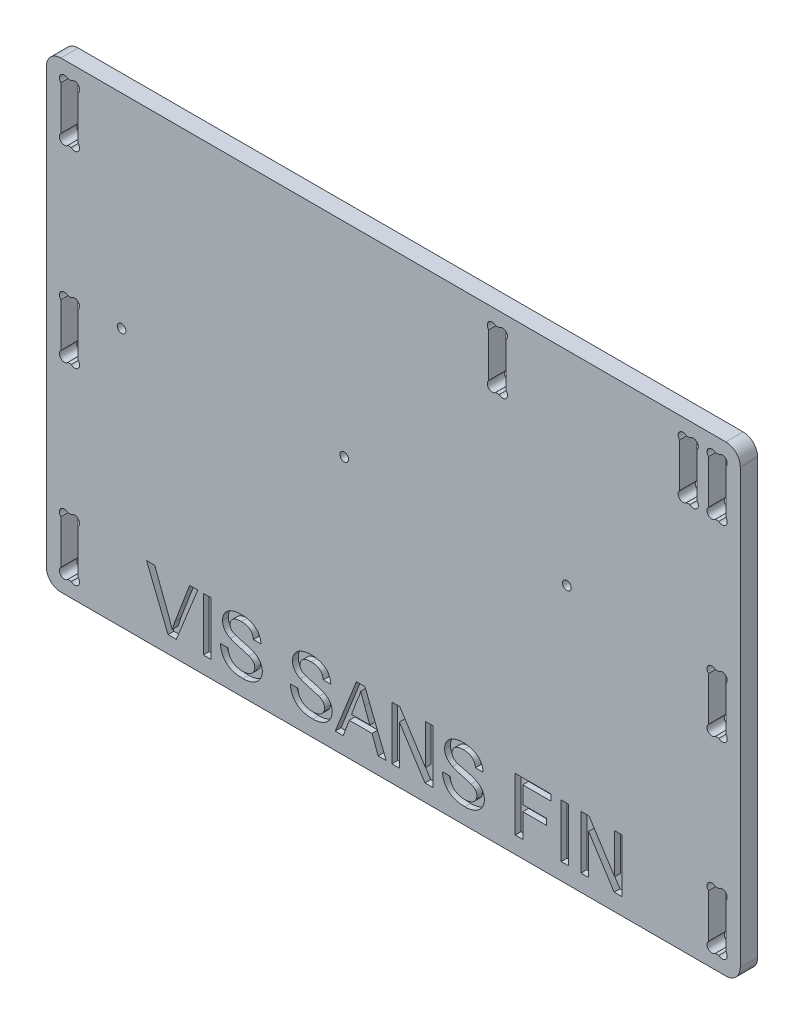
from build123d import *

# Parameters (mm, degrees)
ESQUISSE1_R             = 1.5
EXTRUSION1_DEPTH        = 6
ESQUISSE3_W             = 2.60783128
ESQUISSE3_H             = 18.491894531
ENL_V_MAT_EXTRU_1_DEPTH = 2


with BuildPart() as part:
    # Esquisse1 → Extrusion1 (new body)
    with BuildSketch(Plane.XY):
        with BuildLine():
            Line((5, 160), (235, 160))
            ThreePointArc((235, 160), (238.535533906, 158.535533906), (240, 155))
            Line((240, 155), (240, 5))
            ThreePointArc((240, 5), (238.535533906, 1.464466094), (235, 0))
            Line((235, 0), (5, 0))
            ThreePointArc((5, 0), (1.464466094, 1.464466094), (0, 5))
            Line((0, 5), (0, 155))
            ThreePointArc((0, 155), (1.464466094, 158.535533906), (5, 160))
        make_face()
        with Locations((26, 89.5)):
            Circle(ESQUISSE1_R, mode=Mode.SUBTRACT)
        with Locations(Location((103, 89.5, 0), (0, 0, 180))):
            Circle(ESQUISSE1_R, mode=Mode.SUBTRACT)
        with Locations(Location((180, 89.5, 0), (0, 0, 180))):
            Circle(ESQUISSE1_R, mode=Mode.SUBTRACT)
        with BuildLine():
            Line((7.404163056, 25), (8.595836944, 25))
            ThreePointArc((8.595836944, 25), (11, 25), (11, 22.595836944))
            Line((11, 22.595836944), (11, 7.404163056))
            ThreePointArc((11, 7.404163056), (11, 5), (8.595836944, 5))
            Line((8.595836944, 5), (7.404163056, 5))
            ThreePointArc((7.404163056, 5), (5, 5), (5, 7.404163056))
            Line((5, 7.404163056), (5, 22.595836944))
            ThreePointArc((5, 22.595836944), (5, 25), (7.404163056, 25))
        make_face(mode=Mode.SUBTRACT)
        with BuildLine():
            Line((156.595836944, 135), (155.404163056, 135))
            ThreePointArc((155.404163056, 135), (153, 135), (153, 137.404163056))
            Line((153, 137.404163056), (153, 152.595836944))
            ThreePointArc((153, 152.595836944), (153, 155), (155.404163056, 155))
            Line((155.404163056, 155), (156.595836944, 155))
            ThreePointArc((156.595836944, 155), (159, 155), (159, 152.595836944))
            Line((159, 152.595836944), (159, 137.404163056))
            ThreePointArc((159, 137.404163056), (159, 135), (156.595836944, 135))
        make_face(mode=Mode.SUBTRACT)
        with BuildLine():
            Line((5, 137.404163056), (5, 152.595836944))
            ThreePointArc((5, 152.595836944), (5, 155), (7.404163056, 155))
            Line((7.404163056, 155), (8.595836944, 155))
            ThreePointArc((8.595836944, 155), (11, 155), (11, 152.595836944))
            Line((11, 152.595836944), (11, 137.404163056))
            ThreePointArc((11, 137.404163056), (11, 135), (8.595836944, 135))
            Line((8.595836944, 135), (7.404163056, 135))
            ThreePointArc((7.404163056, 135), (5, 135), (5, 137.404163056))
        make_face(mode=Mode.SUBTRACT)
        with BuildLine():
            Line((7.404163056, 90), (8.595836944, 90))
            ThreePointArc((8.595836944, 90), (11, 90), (11, 87.595836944))
            Line((11, 87.595836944), (11, 72.404163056))
            ThreePointArc((11, 72.404163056), (11, 70), (8.595836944, 70))
            Line((8.595836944, 70), (7.404163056, 70))
            ThreePointArc((7.404163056, 70), (5, 70), (5, 72.404163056))
            Line((5, 72.404163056), (5, 87.595836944))
            ThreePointArc((5, 87.595836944), (5, 90), (7.404163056, 90))
        make_face(mode=Mode.SUBTRACT)
        with BuildLine():
            Line((235, 22.595836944), (235, 7.404163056))
            ThreePointArc((235, 7.404163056), (235, 5), (232.595836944, 5))
            Line((232.595836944, 5), (231.404163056, 5))
            ThreePointArc((231.404163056, 5), (229, 5), (229, 7.404163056))
            Line((229, 7.404163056), (229, 22.595836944))
            ThreePointArc((229, 22.595836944), (229, 25), (231.404163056, 25))
            Line((231.404163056, 25), (232.595836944, 25))
            ThreePointArc((232.595836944, 25), (235, 25), (235, 22.595836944))
        make_face(mode=Mode.SUBTRACT)
        with BuildLine():
            Line((232.595836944, 70), (231.404163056, 70))
            ThreePointArc((231.404163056, 70), (229, 70), (229, 72.404163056))
            Line((229, 72.404163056), (229, 87.595836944))
            ThreePointArc((229, 87.595836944), (229, 90), (231.404163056, 90))
            Line((231.404163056, 90), (232.595836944, 90))
            ThreePointArc((232.595836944, 90), (235, 90), (235, 87.595836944))
            Line((235, 87.595836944), (235, 72.404163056))
            ThreePointArc((235, 72.404163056), (235, 70), (232.595836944, 70))
        make_face(mode=Mode.SUBTRACT)
        with BuildLine():
            Line((232.595836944, 135), (231.404163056, 135))
            ThreePointArc((231.404163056, 135), (229, 135), (229, 137.404163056))
            Line((229, 137.404163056), (229, 152.595836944))
            ThreePointArc((229, 152.595836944), (229, 155), (231.404163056, 155))
            Line((231.404163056, 155), (232.595836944, 155))
            ThreePointArc((232.595836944, 155), (235, 155), (235, 152.595836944))
            Line((235, 152.595836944), (235, 137.404163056))
            ThreePointArc((235, 137.404163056), (235, 135), (232.595836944, 135))
        make_face(mode=Mode.SUBTRACT)
        with BuildLine():
            Line((221.404163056, 135), (222.595836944, 135))
            ThreePointArc((222.595836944, 135), (225, 135), (225, 137.404163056))
            Line((225, 137.404163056), (225, 152.595836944))
            ThreePointArc((225, 152.595836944), (225, 155), (222.595836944, 155))
            Line((222.595836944, 155), (221.404163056, 155))
            ThreePointArc((221.404163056, 155), (219, 155), (219, 152.595836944))
            Line((219, 152.595836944), (219, 137.404163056))
            ThreePointArc((219, 137.404163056), (219, 135), (221.404163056, 135))
        make_face(mode=Mode.SUBTRACT)
    extrude(amount=EXTRUSION1_DEPTH)

    # Esquisse3 → Enl_v. mat.-Extru.1 (cut)
    # profile 1 of 10: a face of its own
    with BuildSketch(Plane.XY.offset(6)):
        with BuildLine():
            Line((42.089619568, 5.811423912), (34.632852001, 24.303318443))
            Line((34.632852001, 24.303318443), (37.459237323, 24.303318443))
            Line((37.459237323, 24.303318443), (42.489684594, 11.049312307))
            add(Edge.make_bspline(
                [(42.489684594, 11.049312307), (42.58812546, 10.787871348), (42.780696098, 10.276438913), (43.049236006, 9.517508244), (43.289294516, 8.783583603), (43.434022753, 8.299783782), (43.504664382, 8.063641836)],
                knots=[0, 0, 0, 0, 1.062747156, 2.078952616, 3.062339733, 4, 4, 4, 4], degree=3))
            add(Edge.make_bspline(
                [(43.504664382, 8.063641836), (43.655050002, 8.56299949), (43.957977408, 9.568874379), (44.32414454, 10.553496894), (44.508531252, 11.049312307)],
                knots=[0, 0, 0, 0, 0.992882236, 2, 2, 2, 2], degree=3))
            Line((44.508531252, 11.049312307), (49.55009144, 24.303318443))
            Line((49.55009144, 24.303318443), (52.376476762, 24.303318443))
            Line((52.376476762, 24.303318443), (44.91600489, 5.811423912))
            Line((44.91600489, 5.811423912), (42.089619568, 5.811423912))
        make_face()
    # profile 2 of 10: a face of its own
    with BuildSketch(Plane.XY.offset(6)):
        with Locations((55.595518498, 15.057371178)):
            Rectangle(ESQUISSE3_W, ESQUISSE3_H)
    # profile 3 of 10: a face of its own
    with BuildSketch(Plane.XY.offset(6)):
        with BuildLine():
            Line((60.218492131, 12.212464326), (62.826323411, 12.212464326))
            add(Edge.make_bspline(
                [(62.826323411, 12.212464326), (62.855008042, 11.978316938), (62.910112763, 11.528507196), (63.064191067, 10.8909696), (63.262499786, 10.317757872), (63.509586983, 9.80126448), (63.834620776, 9.34768215), (64.226230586, 8.938557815), (64.701819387, 8.584280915), (65.238650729, 8.268997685), (65.836531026, 8.021450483), (66.474821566, 7.837939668), (67.15047826, 7.729208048), (67.613126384, 7.715187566), (67.84936207, 7.708028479)],
                knots=[0, 0, 0, 0, 1.125557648, 2.162256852, 3.1243583, 4.018160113, 4.88511607, 5.777380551, 6.711250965, 7.707237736, 8.743031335, 9.791730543, 10.872421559, 12, 12, 12, 12], degree=3))
            add(Edge.make_bspline(
                [(67.84936207, 7.708028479), (68.058410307, 7.711897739), (68.466013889, 7.719442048), (69.055658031, 7.81006788), (69.610514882, 7.938618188), (70.120257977, 8.133070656), (70.583006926, 8.369196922), (70.984852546, 8.654797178), (71.32792696, 8.976875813), (71.596579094, 9.343916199), (71.807626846, 9.728513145), (71.96245219, 10.12383914), (72.054678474, 10.527699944), (72.066430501, 10.799438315), (72.072270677, 10.934478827)],
                knots=[0, 0, 0, 0, 1.267006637, 2.470417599, 3.611360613, 4.716023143, 5.771382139, 6.754486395, 7.697536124, 8.612899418, 9.501261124, 10.352596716, 11.181322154, 12, 12, 12, 12], degree=3))
            add(Edge.make_bspline(
                [(72.072270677, 10.934478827), (72.066027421, 11.068151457), (72.053824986, 11.329414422), (71.974305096, 11.709780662), (71.823166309, 12.057926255), (71.627046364, 12.38806088), (71.354210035, 12.689897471), (71.009512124, 12.968012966), (70.58535807, 13.220155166), (70.26879088, 13.358242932), (70.101579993, 13.431180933)],
                knots=[0, 0, 0, 0, 0.942140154, 1.841411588, 2.718743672, 3.605002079, 4.535543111, 5.568170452, 6.715506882, 8, 8, 8, 8], degree=3))
            add(Edge.make_bspline(
                [(70.101579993, 13.431180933), (70.036432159, 13.457915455), (69.889251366, 13.518313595), (69.636990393, 13.598270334), (69.337650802, 13.701662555), (68.9840412, 13.808139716), (68.578054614, 13.920777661), (68.120366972, 14.048266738), (67.611234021, 14.183844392), (67.065095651, 14.328152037), (66.513662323, 14.474890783), (65.986832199, 14.621766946), (65.50212344, 14.770865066), (65.055565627, 14.914425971), (64.649460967, 15.058579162), (64.282656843, 15.199378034), (63.954695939, 15.333965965), (63.754389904, 15.432926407), (63.659792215, 15.479662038)],
                knots=[0, 0, 0, 0, 0.499201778, 1.127787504, 1.87543728, 2.745208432, 3.745951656, 4.863402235, 6.114490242, 7.482339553, 8.869366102, 10.161191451, 11.360587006, 12.46547846, 13.487450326, 14.41601931, 15.251940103, 16, 16, 16, 16], degree=3))
            add(Edge.make_bspline(
                [(63.659792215, 15.479662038), (63.442149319, 15.597239), (63.022041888, 15.824193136), (62.456623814, 16.229987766), (61.980201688, 16.680292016), (61.594785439, 17.174452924), (61.292749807, 17.704113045), (61.088967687, 18.270172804), (60.949393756, 18.862357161), (60.936350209, 19.269576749), (60.929718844, 19.476607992)],
                knots=[0, 0, 0, 0, 1.158441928, 2.236094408, 3.251151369, 4.220012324, 5.163146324, 6.095083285, 7.031536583, 8, 8, 8, 8], degree=3))
            add(Edge.make_bspline(
                [(60.929718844, 19.476607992), (60.938519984, 19.705860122), (60.95602539, 20.161840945), (61.111307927, 20.830964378), (61.358986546, 21.474839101), (61.640920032, 21.986020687), (61.915867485, 22.372573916), (62.143801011, 22.650962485), (62.399473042, 22.90829529), (62.675009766, 23.148164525), (62.975336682, 23.366986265), (63.29300265, 23.573753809), (63.639505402, 23.751475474), (64.1263933, 23.977675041), (64.77773199, 24.203556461), (65.597685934, 24.400383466), (66.460660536, 24.516290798), (67.048884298, 24.532245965), (67.349280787, 24.540394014)],
                knots=[0, 0, 0, 0, 1.199927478, 2.386647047, 3.578628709, 4.806592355, 5.433127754, 6.062729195, 6.689531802, 7.331674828, 7.974827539, 8.635320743, 9.315455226, 10.01318112, 11.447700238, 12.918145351, 14.426146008, 16, 16, 16, 16], degree=3))
            add(Edge.make_bspline(
                [(67.349280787, 24.540394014), (67.678084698, 24.532859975), (68.318329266, 24.518189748), (69.24862272, 24.396136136), (70.116331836, 24.186537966), (70.796819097, 23.951913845), (71.299895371, 23.714388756), (71.657294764, 23.52905034), (71.989032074, 23.31476537), (72.298093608, 23.082875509), (72.587350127, 22.83348666), (72.84936709, 22.560666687), (73.095522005, 22.273723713), (73.384788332, 21.861763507), (73.696678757, 21.316536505), (73.966350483, 20.610173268), (74.151618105, 19.864664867), (74.18765692, 19.349275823), (74.205950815, 19.087655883)],
                knots=[0, 0, 0, 0, 1.607600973, 3.130308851, 4.577334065, 5.967726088, 6.640410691, 7.296826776, 7.935019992, 8.569057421, 9.185393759, 9.8003086, 10.417295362, 11.032210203, 12.259799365, 13.477607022, 14.719591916, 16, 16, 16, 16], degree=3))
            Line((74.205950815, 19.087655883), (71.598119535, 19.087655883))
            add(Edge.make_bspline(
                [(71.598119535, 19.087655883), (71.581549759, 19.220069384), (71.549127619, 19.479163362), (71.468692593, 19.854240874), (71.355938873, 20.202595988), (71.223869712, 20.527477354), (71.063774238, 20.825505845), (70.877149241, 21.09954319), (70.661722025, 21.346360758), (70.423035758, 21.572480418), (70.153827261, 21.769367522), (69.855479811, 21.940271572), (69.527489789, 22.08464636), (69.170146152, 22.20289402), (68.783378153, 22.294578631), (68.366306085, 22.362023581), (67.919091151, 22.396565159), (67.611101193, 22.403271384), (67.45300135, 22.406713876)],
                knots=[0, 0, 0, 0, 1.074487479, 2.102453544, 3.083708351, 4.020042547, 4.923259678, 5.803182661, 6.684453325, 7.556870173, 8.445961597, 9.363679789, 10.320905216, 11.327237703, 12.390948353, 13.519046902, 14.726457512, 16, 16, 16, 16], degree=3))
            add(Edge.make_bspline(
                [(67.45300135, 22.406713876), (67.288663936, 22.405475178), (66.970547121, 22.403077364), (66.510673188, 22.359368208), (66.084429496, 22.299397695), (65.692548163, 22.210936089), (65.336312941, 22.09513955), (65.01043679, 21.961421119), (64.724039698, 21.791964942), (64.470445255, 21.603212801), (64.251687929, 21.394368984), (64.063151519, 21.174298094), (63.896405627, 20.949465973), (63.766840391, 20.707583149), (63.661354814, 20.457810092), (63.593305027, 20.195451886), (63.545124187, 19.925361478), (63.5401097, 19.741073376), (63.537550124, 19.647006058)],
                knots=[0, 0, 0, 0, 1.464176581, 2.834285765, 4.113735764, 5.29917439, 6.409476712, 7.449999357, 8.431575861, 9.367089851, 10.262376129, 11.120706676, 11.948504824, 12.751342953, 13.560717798, 14.359016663, 15.162382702, 16, 16, 16, 16], degree=3))
            add(Edge.make_bspline(
                [(63.537550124, 19.647006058), (63.544289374, 19.487909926), (63.557369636, 19.179119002), (63.690938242, 18.740420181), (63.896367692, 18.340517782), (64.098748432, 18.122932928), (64.200620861, 18.013407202)],
                knots=[0, 0, 0, 0, 1.050964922, 2.039826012, 3.013306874, 4, 4, 4, 4], degree=3))
            add(Edge.make_bspline(
                [(64.200620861, 18.013407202), (64.264840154, 17.958671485), (64.406857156, 17.837626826), (64.671101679, 17.677438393), (64.998725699, 17.515588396), (65.391918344, 17.354696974), (65.850003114, 17.192810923), (66.372241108, 17.026129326), (66.96062147, 16.860583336), (67.597213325, 16.701052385), (68.240319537, 16.540880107), (68.851486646, 16.381318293), (69.412641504, 16.230097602), (69.922893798, 16.082606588), (70.382771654, 15.939262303), (70.79067683, 15.7970615), (71.149909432, 15.66627283), (71.369981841, 15.574252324), (71.472173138, 15.531522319)],
                knots=[0, 0, 0, 0, 0.523891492, 1.158553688, 1.913783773, 2.794766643, 3.797521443, 4.933638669, 6.202080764, 7.596537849, 9.013317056, 10.322179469, 11.523240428, 12.626146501, 13.623953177, 14.517289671, 15.311498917, 16, 16, 16, 16], degree=3))
            add(Edge.make_bspline(
                [(71.472173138, 15.531522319), (71.605129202, 15.470221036), (71.866099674, 15.349896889), (72.235799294, 15.144461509), (72.580769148, 14.931127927), (72.898222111, 14.704152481), (73.187131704, 14.463057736), (73.450728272, 14.210606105), (73.690603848, 13.948216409), (73.897079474, 13.667490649), (74.082473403, 13.379777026), (74.244705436, 13.081054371), (74.375331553, 12.769565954), (74.489898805, 12.449066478), (74.572305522, 12.115991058), (74.636929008, 11.773703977), (74.674622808, 11.420596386), (74.678259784, 11.181520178), (74.680101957, 11.060425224)],
                knots=[0, 0, 0, 0, 1.198900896, 2.353241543, 3.461831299, 4.520043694, 5.547003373, 6.541368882, 7.508191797, 8.454912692, 9.392021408, 10.310662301, 11.235020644, 12.156274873, 13.095836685, 14.042125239, 15.00831306, 16, 16, 16, 16], degree=3))
            add(Edge.make_bspline(
                [(74.680101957, 11.060425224), (74.670451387, 10.818752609), (74.651291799, 10.338952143), (74.486320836, 9.631704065), (74.227160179, 8.946384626), (73.923230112, 8.4025459), (73.635924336, 7.987132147), (73.394573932, 7.688551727), (73.12693021, 7.41246863), (72.839582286, 7.150233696), (72.530299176, 6.907197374), (72.19647343, 6.683276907), (71.841628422, 6.476141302), (71.334918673, 6.223734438), (70.661923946, 5.95969289), (69.80466377, 5.739808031), (68.901215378, 5.597163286), (68.280851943, 5.582058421), (67.964195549, 5.574348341)],
                knots=[0, 0, 0, 0, 1.197055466, 2.376552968, 3.581957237, 4.820753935, 5.454298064, 6.085440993, 6.72202542, 7.359198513, 8.013298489, 8.67051481, 9.351020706, 10.049282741, 11.476266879, 12.925760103, 14.430794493, 16, 16, 16, 16], degree=3))
            add(Edge.make_bspline(
                [(67.964195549, 5.574348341), (67.762858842, 5.576009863), (67.368468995, 5.579264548), (66.788957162, 5.618679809), (66.233600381, 5.675695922), (65.702943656, 5.760622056), (65.198651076, 5.872040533), (64.718912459, 6.00583259), (64.262590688, 6.159921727), (63.831280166, 6.341127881), (63.426106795, 6.551669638), (63.039785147, 6.778790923), (62.678629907, 7.036243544), (62.341880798, 7.319982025), (62.021005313, 7.621809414), (61.729302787, 7.954052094), (61.456856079, 8.306994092), (61.209890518, 8.683865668), (60.989264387, 9.079736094), (60.790858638, 9.487957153), (60.623699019, 9.911490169), (60.488984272, 10.348194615), (60.37487406, 10.79514806), (60.295741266, 11.256079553), (60.23756017, 11.729541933), (60.224885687, 12.050539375), (60.218492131, 12.212464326)],
                knots=[0, 0, 0, 0, 1.259822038, 2.467811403, 3.633536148, 4.752793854, 5.829021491, 6.863980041, 7.868367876, 8.841470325, 9.788447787, 10.724101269, 11.643985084, 12.560193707, 13.478453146, 14.398077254, 15.323914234, 16.266973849, 17.21495974, 18.158525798, 19.105629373, 20.061269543, 21.017128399, 21.990322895, 22.986232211, 24, 24, 24, 24], degree=3))
        make_face()
    # profile 4 of 10: a face of its own
    with BuildSketch(Plane.XY.offset(6)):
        with BuildLine():
            Line((84.400200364, 12.212464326), (87.008031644, 12.212464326))
            add(Edge.make_bspline(
                [(87.008031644, 12.212464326), (87.036716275, 11.978316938), (87.091820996, 11.528507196), (87.2458993, 10.8909696), (87.444208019, 10.317757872), (87.691295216, 9.80126448), (88.016329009, 9.34768215), (88.407938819, 8.938557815), (88.88352762, 8.584280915), (89.420358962, 8.268997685), (90.018239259, 8.021450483), (90.656529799, 7.837939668), (91.332186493, 7.729208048), (91.794834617, 7.715187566), (92.031070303, 7.708028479)],
                knots=[0, 0, 0, 0, 1.125557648, 2.162256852, 3.1243583, 4.018160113, 4.88511607, 5.777380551, 6.711250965, 7.707237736, 8.743031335, 9.791730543, 10.872421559, 12, 12, 12, 12], degree=3))
            add(Edge.make_bspline(
                [(92.031070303, 7.708028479), (92.24011854, 7.711897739), (92.647722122, 7.719442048), (93.237366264, 7.81006788), (93.792223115, 7.938618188), (94.30196621, 8.133070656), (94.764715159, 8.369196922), (95.166560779, 8.654797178), (95.509635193, 8.976875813), (95.778287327, 9.343916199), (95.98933508, 9.728513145), (96.144160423, 10.12383914), (96.236386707, 10.527699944), (96.248138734, 10.799438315), (96.25397891, 10.934478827)],
                knots=[0, 0, 0, 0, 1.267006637, 2.470417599, 3.611360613, 4.716023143, 5.771382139, 6.754486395, 7.697536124, 8.612899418, 9.501261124, 10.352596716, 11.181322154, 12, 12, 12, 12], degree=3))
            add(Edge.make_bspline(
                [(96.25397891, 10.934478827), (96.247735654, 11.068151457), (96.235533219, 11.329414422), (96.156013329, 11.709780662), (96.004874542, 12.057926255), (95.808754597, 12.38806088), (95.535918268, 12.689897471), (95.191220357, 12.968012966), (94.767066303, 13.220155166), (94.450499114, 13.358242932), (94.283288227, 13.431180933)],
                knots=[0, 0, 0, 0, 0.942140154, 1.841411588, 2.718743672, 3.605002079, 4.535543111, 5.568170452, 6.715506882, 8, 8, 8, 8], degree=3))
            add(Edge.make_bspline(
                [(94.283288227, 13.431180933), (94.218140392, 13.457915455), (94.070959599, 13.518313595), (93.818698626, 13.598270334), (93.519359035, 13.701662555), (93.165749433, 13.808139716), (92.759762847, 13.920777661), (92.302075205, 14.048266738), (91.792942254, 14.183844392), (91.246803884, 14.328152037), (90.695370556, 14.474890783), (90.168540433, 14.621766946), (89.683831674, 14.770865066), (89.23727386, 14.914425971), (88.8311692, 15.058579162), (88.464365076, 15.199378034), (88.136404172, 15.333965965), (87.936098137, 15.432926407), (87.841500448, 15.479662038)],
                knots=[0, 0, 0, 0, 0.499201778, 1.127787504, 1.87543728, 2.745208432, 3.745951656, 4.863402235, 6.114490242, 7.482339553, 8.869366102, 10.161191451, 11.360587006, 12.46547846, 13.487450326, 14.41601931, 15.251940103, 16, 16, 16, 16], degree=3))
            add(Edge.make_bspline(
                [(87.841500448, 15.479662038), (87.623857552, 15.597239), (87.203750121, 15.824193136), (86.638332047, 16.229987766), (86.161909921, 16.680292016), (85.776493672, 17.174452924), (85.47445804, 17.704113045), (85.27067592, 18.270172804), (85.131101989, 18.862357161), (85.118058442, 19.269576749), (85.111427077, 19.476607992)],
                knots=[0, 0, 0, 0, 1.158441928, 2.236094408, 3.251151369, 4.220012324, 5.163146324, 6.095083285, 7.031536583, 8, 8, 8, 8], degree=3))
            add(Edge.make_bspline(
                [(85.111427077, 19.476607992), (85.120228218, 19.705860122), (85.137733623, 20.161840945), (85.29301616, 20.830964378), (85.540694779, 21.474839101), (85.822628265, 21.986020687), (86.097575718, 22.372573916), (86.325509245, 22.650962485), (86.581181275, 22.90829529), (86.856717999, 23.148164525), (87.157044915, 23.366986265), (87.474710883, 23.573753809), (87.821213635, 23.751475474), (88.308101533, 23.977675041), (88.959440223, 24.203556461), (89.779394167, 24.400383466), (90.642368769, 24.516290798), (91.230592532, 24.532245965), (91.53098902, 24.540394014)],
                knots=[0, 0, 0, 0, 1.199927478, 2.386647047, 3.578628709, 4.806592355, 5.433127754, 6.062729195, 6.689531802, 7.331674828, 7.974827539, 8.635320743, 9.315455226, 10.01318112, 11.447700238, 12.918145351, 14.426146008, 16, 16, 16, 16], degree=3))
            add(Edge.make_bspline(
                [(91.53098902, 24.540394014), (91.859792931, 24.532859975), (92.500037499, 24.518189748), (93.430330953, 24.396136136), (94.29804007, 24.186537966), (94.97852733, 23.951913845), (95.481603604, 23.714388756), (95.839002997, 23.52905034), (96.170740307, 23.31476537), (96.479801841, 23.082875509), (96.76905836, 22.83348666), (97.031075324, 22.560666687), (97.277230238, 22.273723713), (97.566496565, 21.861763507), (97.87838699, 21.316536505), (98.148058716, 20.610173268), (98.333326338, 19.864664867), (98.369365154, 19.349275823), (98.387659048, 19.087655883)],
                knots=[0, 0, 0, 0, 1.607600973, 3.130308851, 4.577334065, 5.967726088, 6.640410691, 7.296826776, 7.935019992, 8.569057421, 9.185393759, 9.8003086, 10.417295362, 11.032210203, 12.259799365, 13.477607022, 14.719591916, 16, 16, 16, 16], degree=3))
            Line((98.387659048, 19.087655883), (95.779827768, 19.087655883))
            add(Edge.make_bspline(
                [(95.779827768, 19.087655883), (95.763257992, 19.220069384), (95.730835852, 19.479163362), (95.650400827, 19.854240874), (95.537647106, 20.202595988), (95.405577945, 20.527477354), (95.245482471, 20.825505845), (95.058857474, 21.09954319), (94.843430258, 21.346360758), (94.604743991, 21.572480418), (94.335535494, 21.769367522), (94.037188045, 21.940271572), (93.709198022, 22.08464636), (93.351854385, 22.20289402), (92.965086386, 22.294578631), (92.548014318, 22.362023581), (92.100799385, 22.396565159), (91.792809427, 22.403271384), (91.634709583, 22.406713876)],
                knots=[0, 0, 0, 0, 1.074487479, 2.102453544, 3.083708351, 4.020042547, 4.923259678, 5.803182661, 6.684453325, 7.556870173, 8.445961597, 9.363679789, 10.320905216, 11.327237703, 12.390948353, 13.519046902, 14.726457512, 16, 16, 16, 16], degree=3))
            add(Edge.make_bspline(
                [(91.634709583, 22.406713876), (91.470372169, 22.405475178), (91.152255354, 22.403077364), (90.692381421, 22.359368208), (90.266137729, 22.299397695), (89.874256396, 22.210936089), (89.518021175, 22.09513955), (89.192145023, 21.961421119), (88.905747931, 21.791964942), (88.652153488, 21.603212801), (88.433396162, 21.394368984), (88.244859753, 21.174298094), (88.07811386, 20.949465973), (87.948548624, 20.707583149), (87.843063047, 20.457810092), (87.77501326, 20.195451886), (87.726832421, 19.925361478), (87.721817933, 19.741073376), (87.719258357, 19.647006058)],
                knots=[0, 0, 0, 0, 1.464176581, 2.834285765, 4.113735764, 5.29917439, 6.409476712, 7.449999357, 8.431575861, 9.367089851, 10.262376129, 11.120706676, 11.948504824, 12.751342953, 13.560717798, 14.359016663, 15.162382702, 16, 16, 16, 16], degree=3))
            add(Edge.make_bspline(
                [(87.719258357, 19.647006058), (87.725997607, 19.487909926), (87.739077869, 19.179119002), (87.872646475, 18.740420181), (88.078075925, 18.340517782), (88.280456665, 18.122932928), (88.382329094, 18.013407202)],
                knots=[0, 0, 0, 0, 1.050964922, 2.039826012, 3.013306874, 4, 4, 4, 4], degree=3))
            add(Edge.make_bspline(
                [(88.382329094, 18.013407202), (88.446548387, 17.958671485), (88.588565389, 17.837626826), (88.852809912, 17.677438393), (89.180433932, 17.515588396), (89.573626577, 17.354696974), (90.031711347, 17.192810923), (90.553949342, 17.026129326), (91.142329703, 16.860583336), (91.778921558, 16.701052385), (92.42202777, 16.540880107), (93.033194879, 16.381318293), (93.594349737, 16.230097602), (94.104602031, 16.082606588), (94.564479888, 15.939262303), (94.972385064, 15.7970615), (95.331617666, 15.66627283), (95.551690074, 15.574252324), (95.653881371, 15.531522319)],
                knots=[0, 0, 0, 0, 0.523891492, 1.158553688, 1.913783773, 2.794766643, 3.797521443, 4.933638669, 6.202080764, 7.596537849, 9.013317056, 10.322179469, 11.523240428, 12.626146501, 13.623953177, 14.517289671, 15.311498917, 16, 16, 16, 16], degree=3))
            add(Edge.make_bspline(
                [(95.653881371, 15.531522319), (95.786837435, 15.470221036), (96.047807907, 15.349896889), (96.417507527, 15.144461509), (96.762477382, 14.931127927), (97.079930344, 14.704152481), (97.368839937, 14.463057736), (97.632436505, 14.210606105), (97.872312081, 13.948216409), (98.078787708, 13.667490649), (98.264181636, 13.379777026), (98.426413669, 13.081054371), (98.557039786, 12.769565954), (98.671607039, 12.449066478), (98.754013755, 12.115991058), (98.818637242, 11.773703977), (98.856331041, 11.420596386), (98.859968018, 11.181520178), (98.86181019, 11.060425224)],
                knots=[0, 0, 0, 0, 1.198900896, 2.353241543, 3.461831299, 4.520043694, 5.547003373, 6.541368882, 7.508191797, 8.454912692, 9.392021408, 10.310662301, 11.235020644, 12.156274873, 13.095836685, 14.042125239, 15.00831306, 16, 16, 16, 16], degree=3))
            add(Edge.make_bspline(
                [(98.86181019, 11.060425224), (98.85215962, 10.818752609), (98.833000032, 10.338952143), (98.668029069, 9.631704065), (98.408868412, 8.946384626), (98.104938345, 8.4025459), (97.817632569, 7.987132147), (97.576282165, 7.688551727), (97.308638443, 7.41246863), (97.02129052, 7.150233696), (96.712007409, 6.907197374), (96.378181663, 6.683276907), (96.023336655, 6.476141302), (95.516626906, 6.223734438), (94.84363218, 5.95969289), (93.986372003, 5.739808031), (93.082923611, 5.597163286), (92.462560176, 5.582058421), (92.145903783, 5.574348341)],
                knots=[0, 0, 0, 0, 1.197055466, 2.376552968, 3.581957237, 4.820753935, 5.454298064, 6.085440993, 6.72202542, 7.359198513, 8.013298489, 8.67051481, 9.351020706, 10.049282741, 11.476266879, 12.925760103, 14.430794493, 16, 16, 16, 16], degree=3))
            add(Edge.make_bspline(
                [(92.145903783, 5.574348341), (91.944567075, 5.576009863), (91.550177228, 5.579264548), (90.970665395, 5.618679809), (90.415308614, 5.675695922), (89.88465189, 5.760622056), (89.38035931, 5.872040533), (88.900620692, 6.00583259), (88.444298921, 6.159921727), (88.0129884, 6.341127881), (87.607815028, 6.551669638), (87.22149338, 6.778790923), (86.86033814, 7.036243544), (86.523589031, 7.319982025), (86.202713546, 7.621809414), (85.91101102, 7.954052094), (85.638564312, 8.306994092), (85.391598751, 8.683865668), (85.17097262, 9.079736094), (84.972566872, 9.487957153), (84.805407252, 9.911490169), (84.670692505, 10.348194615), (84.556582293, 10.79514806), (84.477449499, 11.256079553), (84.419268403, 11.729541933), (84.40659392, 12.050539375), (84.400200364, 12.212464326)],
                knots=[0, 0, 0, 0, 1.259822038, 2.467811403, 3.633536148, 4.752793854, 5.829021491, 6.863980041, 7.868367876, 8.841470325, 9.788447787, 10.724101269, 11.643985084, 12.560193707, 13.478453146, 14.398077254, 15.323914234, 16.266973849, 17.21495974, 18.158525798, 19.105629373, 20.061269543, 21.017128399, 21.990322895, 22.986232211, 24, 24, 24, 24], degree=3))
        make_face()
    # profile 5 of 10: a face of its own
    with BuildSketch(Plane.XY.offset(6)):
        Polygon((99.887902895, 5.811423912), (107.229836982, 24.303318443), (110.171055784, 24.303318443), (117.51298987, 5.811423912), (114.745873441, 5.811423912), (112.641827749, 11.501237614), (104.759065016, 11.501237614), (102.655019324, 5.811423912), align=None)
        with BuildLine():
            Line((105.544377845, 13.634917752), (111.856514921, 13.634917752))
            Line((111.856514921, 13.634917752), (110.05992661, 18.494966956))
            add(Edge.make_bspline(
                [(110.05992661, 18.494966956), (109.991051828, 18.682752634), (109.856388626, 19.049909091), (109.655565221, 19.583356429), (109.472096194, 20.089939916), (109.292189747, 20.562395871), (109.129784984, 21.007587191), (108.980092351, 21.42250681), (108.8320476, 21.804270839), (108.743203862, 22.050929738), (108.700446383, 22.169638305)],
                knots=[0, 0, 0, 0, 1.225184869, 2.395467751, 3.491410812, 4.525364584, 5.492066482, 6.394148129, 7.227157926, 8, 8, 8, 8], degree=3))
            add(Edge.make_bspline(
                [(108.700446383, 22.169638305), (108.629717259, 21.876913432), (108.487967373, 21.29025669), (108.191177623, 20.430725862), (107.851660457, 19.579055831), (107.575932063, 19.030245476), (107.437278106, 18.754268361)],
                knots=[0, 0, 0, 0, 0.9891762, 1.982431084, 2.985436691, 4, 4, 4, 4], degree=3))
            Line((107.437278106, 18.754268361), (105.544377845, 13.634917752))
        make_face(mode=Mode.SUBTRACT)
    # profile 6 of 10: a face of its own
    with BuildSketch(Plane.XY.offset(6)):
        Polygon((119.487384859, 5.811423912), (119.487384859, 24.303318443), (122.243388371, 24.303318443), (131.104087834, 10.504779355), (131.104087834, 24.303318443), (133.711919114, 24.303318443), (133.711919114, 5.811423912), (130.955915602, 5.811423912), (122.095216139, 19.609963), (122.095216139, 5.811423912), align=None)
    # profile 7 of 10: a face of its own
    with BuildSketch(Plane.XY.offset(6)):
        with BuildLine():
            Line((137.030977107, 12.212464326), (139.638808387, 12.212464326))
            add(Edge.make_bspline(
                [(139.638808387, 12.212464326), (139.667493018, 11.978316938), (139.722597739, 11.528507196), (139.876676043, 10.8909696), (140.074984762, 10.317757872), (140.322071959, 9.80126448), (140.647105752, 9.34768215), (141.038715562, 8.938557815), (141.514304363, 8.584280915), (142.051135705, 8.268997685), (142.649016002, 8.021450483), (143.287306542, 7.837939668), (143.962963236, 7.729208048), (144.425611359, 7.715187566), (144.661847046, 7.708028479)],
                knots=[0, 0, 0, 0, 1.125557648, 2.162256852, 3.1243583, 4.018160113, 4.88511607, 5.777380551, 6.711250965, 7.707237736, 8.743031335, 9.791730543, 10.872421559, 12, 12, 12, 12], degree=3))
            add(Edge.make_bspline(
                [(144.661847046, 7.708028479), (144.870895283, 7.711897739), (145.278498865, 7.719442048), (145.868143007, 7.81006788), (146.422999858, 7.938618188), (146.932742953, 8.133070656), (147.395491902, 8.369196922), (147.797337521, 8.654797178), (148.140411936, 8.976875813), (148.40906407, 9.343916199), (148.620111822, 9.728513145), (148.774937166, 10.12383914), (148.86716345, 10.527699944), (148.878915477, 10.799438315), (148.884755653, 10.934478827)],
                knots=[0, 0, 0, 0, 1.267006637, 2.470417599, 3.611360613, 4.716023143, 5.771382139, 6.754486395, 7.697536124, 8.612899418, 9.501261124, 10.352596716, 11.181322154, 12, 12, 12, 12], degree=3))
            add(Edge.make_bspline(
                [(148.884755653, 10.934478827), (148.878512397, 11.068151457), (148.866309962, 11.329414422), (148.786790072, 11.709780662), (148.635651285, 12.057926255), (148.43953134, 12.38806088), (148.166695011, 12.689897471), (147.8219971, 12.968012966), (147.397843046, 13.220155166), (147.081275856, 13.358242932), (146.914064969, 13.431180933)],
                knots=[0, 0, 0, 0, 0.942140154, 1.841411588, 2.718743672, 3.605002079, 4.535543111, 5.568170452, 6.715506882, 8, 8, 8, 8], degree=3))
            add(Edge.make_bspline(
                [(146.914064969, 13.431180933), (146.848917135, 13.457915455), (146.701736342, 13.518313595), (146.449475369, 13.598270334), (146.150135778, 13.701662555), (145.796526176, 13.808139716), (145.39053959, 13.920777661), (144.932851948, 14.048266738), (144.423718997, 14.183844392), (143.877580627, 14.328152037), (143.326147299, 14.474890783), (142.799317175, 14.621766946), (142.314608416, 14.770865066), (141.868050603, 14.914425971), (141.461945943, 15.058579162), (141.095141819, 15.199378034), (140.767180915, 15.333965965), (140.566874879, 15.432926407), (140.472277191, 15.479662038)],
                knots=[0, 0, 0, 0, 0.499201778, 1.127787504, 1.87543728, 2.745208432, 3.745951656, 4.863402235, 6.114490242, 7.482339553, 8.869366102, 10.161191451, 11.360587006, 12.46547846, 13.487450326, 14.41601931, 15.251940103, 16, 16, 16, 16], degree=3))
            add(Edge.make_bspline(
                [(140.472277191, 15.479662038), (140.254634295, 15.597239), (139.834526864, 15.824193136), (139.26910879, 16.229987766), (138.792686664, 16.680292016), (138.407270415, 17.174452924), (138.105234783, 17.704113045), (137.901452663, 18.270172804), (137.761878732, 18.862357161), (137.748835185, 19.269576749), (137.74220382, 19.476607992)],
                knots=[0, 0, 0, 0, 1.158441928, 2.236094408, 3.251151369, 4.220012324, 5.163146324, 6.095083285, 7.031536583, 8, 8, 8, 8], degree=3))
            add(Edge.make_bspline(
                [(137.74220382, 19.476607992), (137.75100496, 19.705860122), (137.768510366, 20.161840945), (137.923792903, 20.830964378), (138.171471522, 21.474839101), (138.453405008, 21.986020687), (138.728352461, 22.372573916), (138.956285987, 22.650962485), (139.211958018, 22.90829529), (139.487494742, 23.148164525), (139.787821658, 23.366986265), (140.105487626, 23.573753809), (140.451990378, 23.751475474), (140.938878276, 23.977675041), (141.590216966, 24.203556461), (142.41017091, 24.400383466), (143.273145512, 24.516290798), (143.861369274, 24.532245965), (144.161765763, 24.540394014)],
                knots=[0, 0, 0, 0, 1.199927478, 2.386647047, 3.578628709, 4.806592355, 5.433127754, 6.062729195, 6.689531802, 7.331674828, 7.974827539, 8.635320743, 9.315455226, 10.01318112, 11.447700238, 12.918145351, 14.426146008, 16, 16, 16, 16], degree=3))
            add(Edge.make_bspline(
                [(144.161765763, 24.540394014), (144.490569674, 24.532859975), (145.130814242, 24.518189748), (146.061107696, 24.396136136), (146.928816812, 24.186537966), (147.609304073, 23.951913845), (148.112380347, 23.714388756), (148.46977974, 23.52905034), (148.80151705, 23.31476537), (149.110578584, 23.082875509), (149.399835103, 22.83348666), (149.661852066, 22.560666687), (149.908006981, 22.273723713), (150.197273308, 21.861763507), (150.509163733, 21.316536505), (150.778835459, 20.610173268), (150.964103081, 19.864664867), (151.000141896, 19.349275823), (151.018435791, 19.087655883)],
                knots=[0, 0, 0, 0, 1.607600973, 3.130308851, 4.577334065, 5.967726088, 6.640410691, 7.296826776, 7.935019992, 8.569057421, 9.185393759, 9.8003086, 10.417295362, 11.032210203, 12.259799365, 13.477607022, 14.719591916, 16, 16, 16, 16], degree=3))
            Line((151.018435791, 19.087655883), (148.410604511, 19.087655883))
            add(Edge.make_bspline(
                [(148.410604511, 19.087655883), (148.394034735, 19.220069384), (148.361612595, 19.479163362), (148.281177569, 19.854240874), (148.168423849, 20.202595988), (148.036354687, 20.527477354), (147.876259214, 20.825505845), (147.689634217, 21.09954319), (147.474207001, 21.346360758), (147.235520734, 21.572480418), (146.966312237, 21.769367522), (146.667964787, 21.940271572), (146.339974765, 22.08464636), (145.982631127, 22.20289402), (145.595863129, 22.294578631), (145.178791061, 22.362023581), (144.731576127, 22.396565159), (144.423586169, 22.403271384), (144.265486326, 22.406713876)],
                knots=[0, 0, 0, 0, 1.074487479, 2.102453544, 3.083708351, 4.020042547, 4.923259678, 5.803182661, 6.684453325, 7.556870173, 8.445961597, 9.363679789, 10.320905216, 11.327237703, 12.390948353, 13.519046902, 14.726457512, 16, 16, 16, 16], degree=3))
            add(Edge.make_bspline(
                [(144.265486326, 22.406713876), (144.101148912, 22.405475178), (143.783032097, 22.403077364), (143.323158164, 22.359368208), (142.896914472, 22.299397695), (142.505033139, 22.210936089), (142.148797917, 22.09513955), (141.822921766, 21.961421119), (141.536524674, 21.791964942), (141.282930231, 21.603212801), (141.064172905, 21.394368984), (140.875636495, 21.174298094), (140.708890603, 20.949465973), (140.579325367, 20.707583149), (140.47383979, 20.457810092), (140.405790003, 20.195451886), (140.357609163, 19.925361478), (140.352594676, 19.741073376), (140.3500351, 19.647006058)],
                knots=[0, 0, 0, 0, 1.464176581, 2.834285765, 4.113735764, 5.29917439, 6.409476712, 7.449999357, 8.431575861, 9.367089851, 10.262376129, 11.120706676, 11.948504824, 12.751342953, 13.560717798, 14.359016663, 15.162382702, 16, 16, 16, 16], degree=3))
            add(Edge.make_bspline(
                [(140.3500351, 19.647006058), (140.35677435, 19.487909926), (140.369854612, 19.179119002), (140.503423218, 18.740420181), (140.708852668, 18.340517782), (140.911233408, 18.122932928), (141.013105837, 18.013407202)],
                knots=[0, 0, 0, 0, 1.050964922, 2.039826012, 3.013306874, 4, 4, 4, 4], degree=3))
            add(Edge.make_bspline(
                [(141.013105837, 18.013407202), (141.07732513, 17.958671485), (141.219342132, 17.837626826), (141.483586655, 17.677438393), (141.811210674, 17.515588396), (142.20440332, 17.354696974), (142.66248809, 17.192810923), (143.184726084, 17.026129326), (143.773106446, 16.860583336), (144.409698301, 16.701052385), (145.052804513, 16.540880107), (145.663971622, 16.381318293), (146.22512648, 16.230097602), (146.735378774, 16.082606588), (147.19525663, 15.939262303), (147.603161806, 15.7970615), (147.962394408, 15.66627283), (148.182466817, 15.574252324), (148.284658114, 15.531522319)],
                knots=[0, 0, 0, 0, 0.523891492, 1.158553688, 1.913783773, 2.794766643, 3.797521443, 4.933638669, 6.202080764, 7.596537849, 9.013317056, 10.322179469, 11.523240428, 12.626146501, 13.623953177, 14.517289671, 15.311498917, 16, 16, 16, 16], degree=3))
            add(Edge.make_bspline(
                [(148.284658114, 15.531522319), (148.417614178, 15.470221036), (148.67858465, 15.349896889), (149.04828427, 15.144461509), (149.393254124, 14.931127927), (149.710707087, 14.704152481), (149.99961668, 14.463057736), (150.263213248, 14.210606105), (150.503088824, 13.948216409), (150.70956445, 13.667490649), (150.894958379, 13.379777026), (151.057190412, 13.081054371), (151.187816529, 12.769565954), (151.302383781, 12.449066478), (151.384790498, 12.115991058), (151.449413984, 11.773703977), (151.487107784, 11.420596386), (151.49074476, 11.181520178), (151.492586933, 11.060425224)],
                knots=[0, 0, 0, 0, 1.198900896, 2.353241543, 3.461831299, 4.520043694, 5.547003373, 6.541368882, 7.508191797, 8.454912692, 9.392021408, 10.310662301, 11.235020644, 12.156274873, 13.095836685, 14.042125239, 15.00831306, 16, 16, 16, 16], degree=3))
            add(Edge.make_bspline(
                [(151.492586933, 11.060425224), (151.482936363, 10.818752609), (151.463776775, 10.338952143), (151.298805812, 9.631704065), (151.039645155, 8.946384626), (150.735715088, 8.4025459), (150.448409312, 7.987132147), (150.207058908, 7.688551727), (149.939415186, 7.41246863), (149.652067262, 7.150233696), (149.342784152, 6.907197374), (149.008958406, 6.683276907), (148.654113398, 6.476141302), (148.147403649, 6.223734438), (147.474408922, 5.95969289), (146.617148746, 5.739808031), (145.713700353, 5.597163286), (145.093336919, 5.582058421), (144.776680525, 5.574348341)],
                knots=[0, 0, 0, 0, 1.197055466, 2.376552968, 3.581957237, 4.820753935, 5.454298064, 6.085440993, 6.72202542, 7.359198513, 8.013298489, 8.67051481, 9.351020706, 10.049282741, 11.476266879, 12.925760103, 14.430794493, 16, 16, 16, 16], degree=3))
            add(Edge.make_bspline(
                [(144.776680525, 5.574348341), (144.575343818, 5.576009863), (144.180953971, 5.579264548), (143.601442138, 5.618679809), (143.046085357, 5.675695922), (142.515428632, 5.760622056), (142.011136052, 5.872040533), (141.531397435, 6.00583259), (141.075075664, 6.159921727), (140.643765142, 6.341127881), (140.238591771, 6.551669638), (139.852270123, 6.778790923), (139.491114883, 7.036243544), (139.154365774, 7.319982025), (138.833490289, 7.621809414), (138.541787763, 7.954052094), (138.269341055, 8.306994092), (138.022375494, 8.683865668), (137.801749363, 9.079736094), (137.603343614, 9.487957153), (137.436183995, 9.911490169), (137.301469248, 10.348194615), (137.187359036, 10.79514806), (137.108226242, 11.256079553), (137.050045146, 11.729541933), (137.037370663, 12.050539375), (137.030977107, 12.212464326)],
                knots=[0, 0, 0, 0, 1.259822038, 2.467811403, 3.633536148, 4.752793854, 5.829021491, 6.863980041, 7.868367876, 8.841470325, 9.788447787, 10.724101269, 11.643985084, 12.560193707, 13.478453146, 14.398077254, 15.323914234, 16.266973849, 17.21495974, 18.158525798, 19.105629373, 20.061269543, 21.017128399, 21.990322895, 22.986232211, 24, 24, 24, 24], degree=3))
        make_face()
    # profile 8 of 10: a face of its own
    with BuildSketch(Plane.XY.offset(6)):
        Polygon((162.160987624, 5.811423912), (162.160987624, 24.303318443), (174.488917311, 24.303318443), (174.488917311, 22.169638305), (164.768818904, 22.169638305), (164.768818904, 16.242749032), (173.066463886, 16.242749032), (173.066463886, 14.109068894), (164.768818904, 14.109068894), (164.768818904, 5.811423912), align=None)
    # profile 9 of 10: a face of its own
    with BuildSketch(Plane.XY.offset(6)):
        with Locations((179.348966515, 15.057371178)):
            Rectangle(ESQUISSE3_W, ESQUISSE3_H)
    # profile 10 of 10: a face of its own
    with BuildSketch(Plane.XY.offset(6)):
        Polygon((184.920242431, 5.811423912), (184.920242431, 24.303318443), (187.676245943, 24.303318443), (196.536945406, 10.504779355), (196.536945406, 24.303318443), (199.144776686, 24.303318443), (199.144776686, 5.811423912), (196.388773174, 5.811423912), (187.528073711, 19.609963), (187.528073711, 5.811423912), align=None)
    extrude(amount=-ENL_V_MAT_EXTRU_1_DEPTH, mode=Mode.SUBTRACT)


solid = part.part
